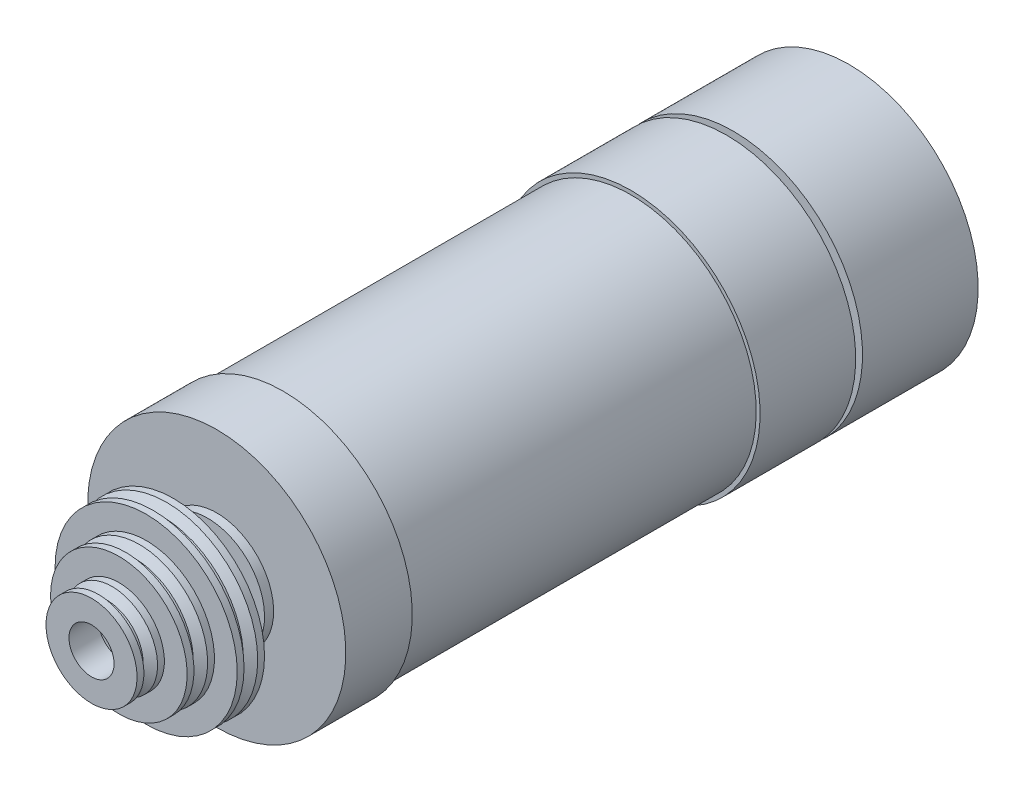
ISO-10303-21;
HEADER;
FILE_DESCRIPTION(('STEP AP214'),'2;1');
FILE_NAME('part.step','',(''),(''),'','','');
FILE_SCHEMA(('AUTOMOTIVE_DESIGN { 1 0 10303 214 1 1 1 1 }'));
ENDSEC;
DATA;
#1=APPLICATION_CONTEXT('core data for automotive mechanical design processes');
#2=APPLICATION_PROTOCOL_DEFINITION('international standard','automotive_design',2000,#1);
#3=PRODUCT_CONTEXT('',#1,'mechanical');
#4=PRODUCT('Part','Part','',(#3));
#5=PRODUCT_RELATED_PRODUCT_CATEGORY('part','',(#4));
#6=PRODUCT_DEFINITION_FORMATION('','',#4);
#7=PRODUCT_DEFINITION_CONTEXT('part definition',#1,'design');
#8=PRODUCT_DEFINITION('design','',#6,#7);
#9=PRODUCT_DEFINITION_SHAPE('','',#8);
#10=(LENGTH_UNIT() NAMED_UNIT(*) SI_UNIT(.MILLI.,.METRE.));
#11=(NAMED_UNIT(*) PLANE_ANGLE_UNIT() SI_UNIT($,.RADIAN.));
#12=(NAMED_UNIT(*) SI_UNIT($,.STERADIAN.) SOLID_ANGLE_UNIT());
#13=UNCERTAINTY_MEASURE_WITH_UNIT(LENGTH_MEASURE(1.E-05),#10,'distance_accuracy_value','');
#14=(GEOMETRIC_REPRESENTATION_CONTEXT(3) GLOBAL_UNCERTAINTY_ASSIGNED_CONTEXT((#13)) GLOBAL_UNIT_ASSIGNED_CONTEXT((#10,
#11,#12)) REPRESENTATION_CONTEXT('',''));
#15=CARTESIAN_POINT('',(0.,0.,0.));
#16=DIRECTION('',(0.,0.,1.));
#17=DIRECTION('',(1.,0.,0.));
#18=AXIS2_PLACEMENT_3D('',#15,#16,#17);
#19=CARTESIAN_POINT('',(0.,0.,96.9503713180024));
#20=DIRECTION('',(0.,0.,1.));
#21=DIRECTION('',(0.,-1.,0.));
#22=AXIS2_PLACEMENT_3D('',#19,#20,#21);
#23=CYLINDRICAL_SURFACE('',#22,4.94999999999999);
#24=CARTESIAN_POINT('',(0.,0.,58.5));
#25=DIRECTION('',(0.,0.,-1.));
#26=DIRECTION('',(-1.,0.,0.));
#27=AXIS2_PLACEMENT_3D('',#24,#25,#26);
#28=CIRCLE('',#27,4.94999999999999);
#29=CARTESIAN_POINT('',(-4.94999999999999,0.,58.5));
#30=VERTEX_POINT('',#29);
#31=EDGE_CURVE('E186',#30,#30,#28,.T.);
#32=ORIENTED_EDGE('',*,*,#31,.T.);
#33=EDGE_LOOP('',(#32));
#34=FACE_BOUND('',#33,.T.);
#35=CARTESIAN_POINT('',(0.,0.,58.));
#36=DIRECTION('',(0.,0.,1.));
#37=DIRECTION('',(0.,-1.,0.));
#38=AXIS2_PLACEMENT_3D('',#35,#36,#37);
#39=CIRCLE('',#38,4.94999999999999);
#40=CARTESIAN_POINT('',(0.,-4.94999999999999,58.));
#41=VERTEX_POINT('',#40);
#42=EDGE_CURVE('E10',#41,#41,#39,.T.);
#43=ORIENTED_EDGE('',*,*,#42,.T.);
#44=EDGE_LOOP('',(#43));
#45=FACE_BOUND('',#44,.T.);
#46=ADVANCED_FACE('F38',(#34,#45),#23,.T.);
#47=CARTESIAN_POINT('',(0.,4.95,58.));
#48=DIRECTION('',(0.,0.,-1.));
#49=DIRECTION('',(0.,1.,0.));
#50=AXIS2_PLACEMENT_3D('',#47,#48,#49);
#51=PLANE('',#50);
#52=ORIENTED_EDGE('',*,*,#42,.F.);
#53=EDGE_LOOP('',(#52));
#54=FACE_BOUND('',#53,.T.);
#55=CARTESIAN_POINT('',(0.,0.,58.));
#56=DIRECTION('',(0.,0.,1.));
#57=DIRECTION('',(0.,-1.,0.));
#58=AXIS2_PLACEMENT_3D('',#55,#56,#57);
#59=CIRCLE('',#58,12.5);
#60=CARTESIAN_POINT('',(0.,-12.5,58.));
#61=VERTEX_POINT('',#60);
#62=EDGE_CURVE('E46',#61,#61,#59,.T.);
#63=ORIENTED_EDGE('',*,*,#62,.T.);
#64=EDGE_LOOP('',(#63));
#65=FACE_BOUND('',#64,.T.);
#66=ADVANCED_FACE('F219',(#54,#65),#51,.F.);
#67=CARTESIAN_POINT('',(0.,0.,96.9503713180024));
#68=DIRECTION('',(0.,0.,1.));
#69=DIRECTION('',(0.,-1.,0.));
#70=AXIS2_PLACEMENT_3D('',#67,#68,#69);
#71=CYLINDRICAL_SURFACE('',#70,12.5);
#72=ORIENTED_EDGE('',*,*,#62,.F.);
#73=EDGE_LOOP('',(#72));
#74=FACE_BOUND('',#73,.T.);
#75=CARTESIAN_POINT('',(0.,0.,56.));
#76=DIRECTION('',(0.,0.,1.));
#77=DIRECTION('',(0.,-1.,0.));
#78=AXIS2_PLACEMENT_3D('',#75,#76,#77);
#79=CIRCLE('',#78,12.5);
#80=CARTESIAN_POINT('',(0.,-12.5,56.));
#81=VERTEX_POINT('',#80);
#82=EDGE_CURVE('E51',#81,#81,#79,.T.);
#83=ORIENTED_EDGE('',*,*,#82,.T.);
#84=EDGE_LOOP('',(#83));
#85=FACE_BOUND('',#84,.T.);
#86=ADVANCED_FACE('F223',(#74,#85),#71,.T.);
#87=CARTESIAN_POINT('',(0.,12.5,56.));
#88=DIRECTION('',(0.,0.,-1.));
#89=DIRECTION('',(0.,1.,0.));
#90=AXIS2_PLACEMENT_3D('',#87,#88,#89);
#91=PLANE('',#90);
#92=ORIENTED_EDGE('',*,*,#82,.F.);
#93=EDGE_LOOP('',(#92));
#94=FACE_BOUND('',#93,.T.);
#95=CARTESIAN_POINT('',(0.,0.,56.));
#96=DIRECTION('',(0.,0.,1.));
#97=DIRECTION('',(0.,-1.,0.));
#98=AXIS2_PLACEMENT_3D('',#95,#96,#97);
#99=CIRCLE('',#98,28.35);
#100=CARTESIAN_POINT('',(0.,-28.35,56.));
#101=VERTEX_POINT('',#100);
#102=EDGE_CURVE('E56',#101,#101,#99,.T.);
#103=ORIENTED_EDGE('',*,*,#102,.T.);
#104=EDGE_LOOP('',(#103));
#105=FACE_BOUND('',#104,.T.);
#106=ADVANCED_FACE('F229',(#94,#105),#91,.F.);
#107=CARTESIAN_POINT('',(0.,0.,96.9503713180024));
#108=DIRECTION('',(0.,0.,1.));
#109=DIRECTION('',(0.,-1.,0.));
#110=AXIS2_PLACEMENT_3D('',#107,#108,#109);
#111=CYLINDRICAL_SURFACE('',#110,28.35);
#112=ORIENTED_EDGE('',*,*,#102,.F.);
#113=EDGE_LOOP('',(#112));
#114=FACE_BOUND('',#113,.T.);
#115=CARTESIAN_POINT('',(0.,0.,41.4));
#116=DIRECTION('',(0.,0.,1.));
#117=DIRECTION('',(0.,-1.,0.));
#118=AXIS2_PLACEMENT_3D('',#115,#116,#117);
#119=CIRCLE('',#118,28.35);
#120=CARTESIAN_POINT('',(0.,-28.35,41.4));
#121=VERTEX_POINT('',#120);
#122=EDGE_CURVE('E62',#121,#121,#119,.T.);
#123=ORIENTED_EDGE('',*,*,#122,.T.);
#124=EDGE_LOOP('',(#123));
#125=FACE_BOUND('',#124,.T.);
#126=ADVANCED_FACE('F233',(#114,#125),#111,.T.);
#127=CARTESIAN_POINT('',(0.,28.35,41.4));
#128=DIRECTION('',(0.,0.,1.));
#129=DIRECTION('',(0.,-1.,0.));
#130=AXIS2_PLACEMENT_3D('',#127,#128,#129);
#131=PLANE('',#130);
#132=ORIENTED_EDGE('',*,*,#122,.F.);
#133=EDGE_LOOP('',(#132));
#134=FACE_BOUND('',#133,.T.);
#135=CARTESIAN_POINT('',(0.,0.,41.4));
#136=DIRECTION('',(0.,0.,1.));
#137=DIRECTION('',(0.,-1.,0.));
#138=AXIS2_PLACEMENT_3D('',#135,#136,#137);
#139=CIRCLE('',#138,27.5);
#140=CARTESIAN_POINT('',(0.,-27.5,41.4));
#141=VERTEX_POINT('',#140);
#142=EDGE_CURVE('E66',#141,#141,#139,.T.);
#143=ORIENTED_EDGE('',*,*,#142,.T.);
#144=EDGE_LOOP('',(#143));
#145=FACE_BOUND('',#144,.T.);
#146=ADVANCED_FACE('F237',(#134,#145),#131,.F.);
#147=CARTESIAN_POINT('',(0.,0.,96.9503713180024));
#148=DIRECTION('',(0.,0.,1.));
#149=DIRECTION('',(0.,-1.,0.));
#150=AXIS2_PLACEMENT_3D('',#147,#148,#149);
#151=CYLINDRICAL_SURFACE('',#150,27.5);
#152=ORIENTED_EDGE('',*,*,#142,.F.);
#153=EDGE_LOOP('',(#152));
#154=FACE_BOUND('',#153,.T.);
#155=CARTESIAN_POINT('',(0.,0.,-35.));
#156=DIRECTION('',(0.,0.,1.));
#157=DIRECTION('',(0.,-1.,0.));
#158=AXIS2_PLACEMENT_3D('',#155,#156,#157);
#159=CIRCLE('',#158,27.5);
#160=CARTESIAN_POINT('',(0.,-27.5,-35.));
#161=VERTEX_POINT('',#160);
#162=EDGE_CURVE('E70',#161,#161,#159,.T.);
#163=ORIENTED_EDGE('',*,*,#162,.T.);
#164=EDGE_LOOP('',(#163));
#165=FACE_BOUND('',#164,.T.);
#166=ADVANCED_FACE('F241',(#154,#165),#151,.T.);
#167=CARTESIAN_POINT('',(0.,27.5,-35.));
#168=DIRECTION('',(0.,0.,-1.));
#169=DIRECTION('',(0.,1.,0.));
#170=AXIS2_PLACEMENT_3D('',#167,#168,#169);
#171=PLANE('',#170);
#172=ORIENTED_EDGE('',*,*,#162,.F.);
#173=EDGE_LOOP('',(#172));
#174=FACE_BOUND('',#173,.T.);
#175=CARTESIAN_POINT('',(0.,0.,-35.));
#176=DIRECTION('',(0.,0.,1.));
#177=DIRECTION('',(0.,-1.,0.));
#178=AXIS2_PLACEMENT_3D('',#175,#176,#177);
#179=CIRCLE('',#178,28.35);
#180=CARTESIAN_POINT('',(0.,-28.35,-35.));
#181=VERTEX_POINT('',#180);
#182=EDGE_CURVE('E74',#181,#181,#179,.T.);
#183=ORIENTED_EDGE('',*,*,#182,.T.);
#184=EDGE_LOOP('',(#183));
#185=FACE_BOUND('',#184,.T.);
#186=ADVANCED_FACE('F245',(#174,#185),#171,.F.);
#187=CARTESIAN_POINT('',(0.,0.,96.9503713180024));
#188=DIRECTION('',(0.,0.,1.));
#189=DIRECTION('',(0.,-1.,0.));
#190=AXIS2_PLACEMENT_3D('',#187,#188,#189);
#191=CYLINDRICAL_SURFACE('',#190,28.35);
#192=ORIENTED_EDGE('',*,*,#182,.F.);
#193=EDGE_LOOP('',(#192));
#194=FACE_BOUND('',#193,.T.);
#195=CARTESIAN_POINT('',(0.,0.,-56.));
#196=DIRECTION('',(0.,0.,1.));
#197=DIRECTION('',(0.,-1.,0.));
#198=AXIS2_PLACEMENT_3D('',#195,#196,#197);
#199=CIRCLE('',#198,28.35);
#200=CARTESIAN_POINT('',(0.,-28.3499999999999,-56.));
#201=VERTEX_POINT('',#200);
#202=EDGE_CURVE('E78',#201,#201,#199,.T.);
#203=ORIENTED_EDGE('',*,*,#202,.T.);
#204=EDGE_LOOP('',(#203));
#205=FACE_BOUND('',#204,.T.);
#206=ADVANCED_FACE('F249',(#194,#205),#191,.T.);
#207=CARTESIAN_POINT('',(0.,28.35,-56.));
#208=DIRECTION('',(0.,0.,1.));
#209=DIRECTION('',(0.,-1.,0.));
#210=AXIS2_PLACEMENT_3D('',#207,#208,#209);
#211=PLANE('',#210);
#212=ORIENTED_EDGE('',*,*,#202,.F.);
#213=EDGE_LOOP('',(#212));
#214=FACE_BOUND('',#213,.T.);
#215=CARTESIAN_POINT('',(0.,0.,-56.));
#216=DIRECTION('',(0.,0.,1.));
#217=DIRECTION('',(0.,-1.,0.));
#218=AXIS2_PLACEMENT_3D('',#215,#216,#217);
#219=CIRCLE('',#218,9.99999999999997);
#220=CARTESIAN_POINT('',(0.,-9.99999999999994,-56.));
#221=VERTEX_POINT('',#220);
#222=EDGE_CURVE('E82',#221,#221,#219,.T.);
#223=ORIENTED_EDGE('',*,*,#222,.T.);
#224=EDGE_LOOP('',(#223));
#225=FACE_BOUND('',#224,.T.);
#226=ADVANCED_FACE('F253',(#214,#225),#211,.F.);
#227=CARTESIAN_POINT('',(0.,0.,96.9503713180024));
#228=DIRECTION('',(0.,0.,1.));
#229=DIRECTION('',(0.,-1.,0.));
#230=AXIS2_PLACEMENT_3D('',#227,#228,#229);
#231=CYLINDRICAL_SURFACE('',#230,9.99999999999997);
#232=ORIENTED_EDGE('',*,*,#222,.F.);
#233=EDGE_LOOP('',(#232));
#234=FACE_BOUND('',#233,.T.);
#235=CARTESIAN_POINT('',(0.,0.,-57.5));
#236=DIRECTION('',(0.,0.,1.));
#237=DIRECTION('',(0.,-1.,0.));
#238=AXIS2_PLACEMENT_3D('',#235,#236,#237);
#239=CIRCLE('',#238,9.99999999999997);
#240=CARTESIAN_POINT('',(0.,-9.99999999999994,-57.5));
#241=VERTEX_POINT('',#240);
#242=EDGE_CURVE('E86',#241,#241,#239,.T.);
#243=ORIENTED_EDGE('',*,*,#242,.T.);
#244=EDGE_LOOP('',(#243));
#245=FACE_BOUND('',#244,.T.);
#246=ADVANCED_FACE('F257',(#234,#245),#231,.T.);
#247=CARTESIAN_POINT('',(0.,10.,-57.5));
#248=DIRECTION('',(0.,0.,-1.));
#249=DIRECTION('',(0.,1.,0.));
#250=AXIS2_PLACEMENT_3D('',#247,#248,#249);
#251=PLANE('',#250);
#252=ORIENTED_EDGE('',*,*,#242,.F.);
#253=EDGE_LOOP('',(#252));
#254=FACE_BOUND('',#253,.T.);
#255=CARTESIAN_POINT('',(0.,0.,-57.5));
#256=DIRECTION('',(0.,0.,1.));
#257=DIRECTION('',(0.,-1.,0.));
#258=AXIS2_PLACEMENT_3D('',#255,#256,#257);
#259=CIRCLE('',#258,28.35);
#260=CARTESIAN_POINT('',(0.,-28.3499999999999,-57.5));
#261=VERTEX_POINT('',#260);
#262=EDGE_CURVE('E90',#261,#261,#259,.T.);
#263=ORIENTED_EDGE('',*,*,#262,.T.);
#264=EDGE_LOOP('',(#263));
#265=FACE_BOUND('',#264,.T.);
#266=ADVANCED_FACE('F261',(#254,#265),#251,.F.);
#267=CARTESIAN_POINT('',(0.,0.,96.9503713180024));
#268=DIRECTION('',(0.,0.,1.));
#269=DIRECTION('',(0.,-1.,0.));
#270=AXIS2_PLACEMENT_3D('',#267,#268,#269);
#271=CYLINDRICAL_SURFACE('',#270,28.35);
#272=ORIENTED_EDGE('',*,*,#262,.F.);
#273=EDGE_LOOP('',(#272));
#274=FACE_BOUND('',#273,.T.);
#275=CARTESIAN_POINT('',(0.,0.,-82.9));
#276=DIRECTION('',(0.,0.,1.));
#277=DIRECTION('',(0.,-1.,0.));
#278=AXIS2_PLACEMENT_3D('',#275,#276,#277);
#279=CIRCLE('',#278,28.35);
#280=CARTESIAN_POINT('',(0.,-28.3499999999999,-82.9));
#281=VERTEX_POINT('',#280);
#282=EDGE_CURVE('E94',#281,#281,#279,.T.);
#283=ORIENTED_EDGE('',*,*,#282,.T.);
#284=EDGE_LOOP('',(#283));
#285=FACE_BOUND('',#284,.T.);
#286=ADVANCED_FACE('F265',(#274,#285),#271,.T.);
#287=CARTESIAN_POINT('',(0.,28.35,-82.9));
#288=DIRECTION('',(0.,0.,1.));
#289=DIRECTION('',(0.,-1.,0.));
#290=AXIS2_PLACEMENT_3D('',#287,#288,#289);
#291=PLANE('',#290);
#292=ORIENTED_EDGE('',*,*,#282,.F.);
#293=EDGE_LOOP('',(#292));
#294=FACE_BOUND('',#293,.T.);
#295=CARTESIAN_POINT('',(0.,0.,-82.9));
#296=DIRECTION('',(0.,0.,1.));
#297=DIRECTION('',(0.,-1.,0.));
#298=AXIS2_PLACEMENT_3D('',#295,#296,#297);
#299=CIRCLE('',#298,4.94999999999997);
#300=CARTESIAN_POINT('',(0.,-4.94999999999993,-82.9));
#301=VERTEX_POINT('',#300);
#302=EDGE_CURVE('E98',#301,#301,#299,.T.);
#303=ORIENTED_EDGE('',*,*,#302,.T.);
#304=EDGE_LOOP('',(#303));
#305=FACE_BOUND('',#304,.T.);
#306=ADVANCED_FACE('F269',(#294,#305),#291,.F.);
#307=CARTESIAN_POINT('',(0.,0.,96.9503713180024));
#308=DIRECTION('',(0.,0.,1.));
#309=DIRECTION('',(0.,-1.,0.));
#310=AXIS2_PLACEMENT_3D('',#307,#308,#309);
#311=CYLINDRICAL_SURFACE('',#310,4.94999999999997);
#312=ORIENTED_EDGE('',*,*,#302,.F.);
#313=EDGE_LOOP('',(#312));
#314=FACE_BOUND('',#313,.T.);
#315=CARTESIAN_POINT('',(0.,0.,-85.7));
#316=DIRECTION('',(0.,0.,1.));
#317=DIRECTION('',(0.,-1.,0.));
#318=AXIS2_PLACEMENT_3D('',#315,#316,#317);
#319=CIRCLE('',#318,4.94999999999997);
#320=CARTESIAN_POINT('',(0.,-4.94999999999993,-85.7));
#321=VERTEX_POINT('',#320);
#322=EDGE_CURVE('E102',#321,#321,#319,.T.);
#323=ORIENTED_EDGE('',*,*,#322,.T.);
#324=EDGE_LOOP('',(#323));
#325=FACE_BOUND('',#324,.T.);
#326=ADVANCED_FACE('F273',(#314,#325),#311,.T.);
#327=CARTESIAN_POINT('',(0.,4.95,-85.7));
#328=DIRECTION('',(0.,0.,1.));
#329=DIRECTION('',(0.,-1.,0.));
#330=AXIS2_PLACEMENT_3D('',#327,#328,#329);
#331=PLANE('',#330);
#332=ORIENTED_EDGE('',*,*,#322,.F.);
#333=EDGE_LOOP('',(#332));
#334=FACE_BOUND('',#333,.T.);
#335=ADVANCED_FACE('F214',(#334),#331,.F.);
#336=CARTESIAN_POINT('',(0.,0.,0.));
#337=DIRECTION('',(0.,0.,-1.));
#338=DIRECTION('',(-1.,0.,0.));
#339=AXIS2_PLACEMENT_3D('',#336,#337,#338);
#340=CYLINDRICAL_SURFACE('',#339,4.94999999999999);
#341=CARTESIAN_POINT('',(0.,0.,83.5));
#342=DIRECTION('',(0.,0.,-1.));
#343=DIRECTION('',(-1.,0.,0.));
#344=AXIS2_PLACEMENT_3D('',#341,#342,#343);
#345=CIRCLE('',#344,4.94999999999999);
#346=CARTESIAN_POINT('',(-4.94999999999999,0.,83.5));
#347=VERTEX_POINT('',#346);
#348=EDGE_CURVE('E182',#347,#347,#345,.T.);
#349=ORIENTED_EDGE('',*,*,#348,.F.);
#350=EDGE_LOOP('',(#349));
#351=FACE_BOUND('',#350,.T.);
#352=CARTESIAN_POINT('',(0.,0.,77.));
#353=DIRECTION('',(0.,0.,-1.));
#354=DIRECTION('',(0.,1.,0.));
#355=AXIS2_PLACEMENT_3D('',#352,#353,#354);
#356=CIRCLE('',#355,4.94999999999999);
#357=CARTESIAN_POINT('',(0.,4.94999999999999,77.));
#358=VERTEX_POINT('',#357);
#359=EDGE_CURVE('E106',#358,#358,#356,.F.);
#360=ORIENTED_EDGE('',*,*,#359,.F.);
#361=EDGE_LOOP('',(#360));
#362=FACE_BOUND('',#361,.T.);
#363=ADVANCED_FACE('F205',(#351,#362),#340,.F.);
#364=CARTESIAN_POINT('',(0.,20.,65.5));
#365=DIRECTION('',(0.,0.,-1.));
#366=DIRECTION('',(-1.,0.,0.));
#367=AXIS2_PLACEMENT_3D('',#364,#365,#366);
#368=PLANE('',#367);
#369=CARTESIAN_POINT('',(0.,0.,65.5));
#370=DIRECTION('',(0.,0.,-1.));
#371=DIRECTION('',(-1.,0.,0.));
#372=AXIS2_PLACEMENT_3D('',#369,#370,#371);
#373=CIRCLE('',#372,20.);
#374=CARTESIAN_POINT('',(-20.,0.,65.5));
#375=VERTEX_POINT('',#374);
#376=EDGE_CURVE('E110',#375,#375,#373,.T.);
#377=ORIENTED_EDGE('',*,*,#376,.T.);
#378=EDGE_LOOP('',(#377));
#379=FACE_BOUND('',#378,.T.);
#380=CARTESIAN_POINT('',(0.,0.,65.5));
#381=DIRECTION('',(0.,0.,-1.));
#382=DIRECTION('',(-1.,0.,0.));
#383=AXIS2_PLACEMENT_3D('',#380,#381,#382);
#384=CIRCLE('',#383,8.99999999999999);
#385=CARTESIAN_POINT('',(-8.99999999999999,0.,65.5));
#386=VERTEX_POINT('',#385);
#387=EDGE_CURVE('E194',#386,#386,#384,.T.);
#388=ORIENTED_EDGE('',*,*,#387,.F.);
#389=EDGE_LOOP('',(#388));
#390=FACE_BOUND('',#389,.T.);
#391=ADVANCED_FACE('F202',(#379,#390),#368,.T.);
#392=CARTESIAN_POINT('',(0.,0.,0.));
#393=DIRECTION('',(0.,0.,-1.));
#394=DIRECTION('',(-1.,0.,0.));
#395=AXIS2_PLACEMENT_3D('',#392,#393,#394);
#396=CYLINDRICAL_SURFACE('',#395,20.);
#397=CARTESIAN_POINT('',(0.,0.,67.));
#398=DIRECTION('',(0.,0.,-1.));
#399=DIRECTION('',(-1.,0.,0.));
#400=AXIS2_PLACEMENT_3D('',#397,#398,#399);
#401=CIRCLE('',#400,20.);
#402=CARTESIAN_POINT('',(-20.,0.,67.));
#403=VERTEX_POINT('',#402);
#404=EDGE_CURVE('E114',#403,#403,#401,.T.);
#405=ORIENTED_EDGE('',*,*,#404,.T.);
#406=EDGE_LOOP('',(#405));
#407=FACE_BOUND('',#406,.T.);
#408=ORIENTED_EDGE('',*,*,#376,.F.);
#409=EDGE_LOOP('',(#408));
#410=FACE_BOUND('',#409,.T.);
#411=ADVANCED_FACE('F204',(#407,#410),#396,.T.);
#412=CARTESIAN_POINT('',(0.,0.,67.));
#413=DIRECTION('',(0.,0.,-1.));
#414=DIRECTION('',(-1.,0.,0.));
#415=AXIS2_PLACEMENT_3D('',#412,#413,#414);
#416=CONICAL_SURFACE('',#415,20.,1.0471975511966);
#417=CARTESIAN_POINT('',(0.,0.,68.1547005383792));
#418=DIRECTION('',(0.,0.,-1.));
#419=DIRECTION('',(-1.,0.,0.));
#420=AXIS2_PLACEMENT_3D('',#417,#418,#419);
#421=CIRCLE('',#420,18.);
#422=CARTESIAN_POINT('',(-18.,0.,68.1547005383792));
#423=VERTEX_POINT('',#422);
#424=EDGE_CURVE('E118',#423,#423,#421,.T.);
#425=ORIENTED_EDGE('',*,*,#424,.T.);
#426=EDGE_LOOP('',(#425));
#427=FACE_BOUND('',#426,.T.);
#428=ORIENTED_EDGE('',*,*,#404,.F.);
#429=EDGE_LOOP('',(#428));
#430=FACE_BOUND('',#429,.T.);
#431=ADVANCED_FACE('F211',(#427,#430),#416,.T.);
#432=CARTESIAN_POINT('',(0.,0.,0.));
#433=DIRECTION('',(0.,0.,-1.));
#434=DIRECTION('',(-1.,0.,0.));
#435=AXIS2_PLACEMENT_3D('',#432,#433,#434);
#436=CYLINDRICAL_SURFACE('',#435,18.);
#437=CARTESIAN_POINT('',(0.,0.,68.8452994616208));
#438=DIRECTION('',(0.,0.,-1.));
#439=DIRECTION('',(-1.,0.,0.));
#440=AXIS2_PLACEMENT_3D('',#437,#438,#439);
#441=CIRCLE('',#440,18.);
#442=CARTESIAN_POINT('',(-18.,0.,68.8452994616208));
#443=VERTEX_POINT('',#442);
#444=EDGE_CURVE('E122',#443,#443,#441,.T.);
#445=ORIENTED_EDGE('',*,*,#444,.T.);
#446=EDGE_LOOP('',(#445));
#447=FACE_BOUND('',#446,.T.);
#448=ORIENTED_EDGE('',*,*,#424,.F.);
#449=EDGE_LOOP('',(#448));
#450=FACE_BOUND('',#449,.T.);
#451=ADVANCED_FACE('F395',(#447,#450),#436,.T.);
#452=CARTESIAN_POINT('',(0.,0.,68.8452994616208));
#453=DIRECTION('',(0.,0.,1.));
#454=DIRECTION('',(1.,0.,0.));
#455=AXIS2_PLACEMENT_3D('',#452,#453,#454);
#456=CONICAL_SURFACE('',#455,18.,1.0471975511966);
#457=CARTESIAN_POINT('',(0.,0.,70.));
#458=DIRECTION('',(0.,0.,-1.));
#459=DIRECTION('',(-1.,0.,0.));
#460=AXIS2_PLACEMENT_3D('',#457,#458,#459);
#461=CIRCLE('',#460,20.);
#462=CARTESIAN_POINT('',(-20.,0.,70.));
#463=VERTEX_POINT('',#462);
#464=EDGE_CURVE('E126',#463,#463,#461,.T.);
#465=ORIENTED_EDGE('',*,*,#464,.T.);
#466=EDGE_LOOP('',(#465));
#467=FACE_BOUND('',#466,.T.);
#468=ORIENTED_EDGE('',*,*,#444,.F.);
#469=EDGE_LOOP('',(#468));
#470=FACE_BOUND('',#469,.T.);
#471=ADVANCED_FACE('F406',(#467,#470),#456,.T.);
#472=CARTESIAN_POINT('',(0.,0.,0.));
#473=DIRECTION('',(0.,0.,-1.));
#474=DIRECTION('',(-1.,0.,0.));
#475=AXIS2_PLACEMENT_3D('',#472,#473,#474);
#476=CYLINDRICAL_SURFACE('',#475,20.);
#477=CARTESIAN_POINT('',(0.,0.,71.5));
#478=DIRECTION('',(0.,0.,-1.));
#479=DIRECTION('',(-1.,0.,0.));
#480=AXIS2_PLACEMENT_3D('',#477,#478,#479);
#481=CIRCLE('',#480,20.);
#482=CARTESIAN_POINT('',(-20.,0.,71.5));
#483=VERTEX_POINT('',#482);
#484=EDGE_CURVE('E130',#483,#483,#481,.T.);
#485=ORIENTED_EDGE('',*,*,#484,.T.);
#486=EDGE_LOOP('',(#485));
#487=FACE_BOUND('',#486,.T.);
#488=ORIENTED_EDGE('',*,*,#464,.F.);
#489=EDGE_LOOP('',(#488));
#490=FACE_BOUND('',#489,.T.);
#491=ADVANCED_FACE('F417',(#487,#490),#476,.T.);
#492=CARTESIAN_POINT('',(0.,20.,71.5));
#493=DIRECTION('',(0.,0.,1.));
#494=DIRECTION('',(1.,0.,0.));
#495=AXIS2_PLACEMENT_3D('',#492,#493,#494);
#496=PLANE('',#495);
#497=CARTESIAN_POINT('',(0.,0.,71.5));
#498=DIRECTION('',(0.,0.,-1.));
#499=DIRECTION('',(-1.,0.,0.));
#500=AXIS2_PLACEMENT_3D('',#497,#498,#499);
#501=CIRCLE('',#500,15.);
#502=CARTESIAN_POINT('',(-15.,0.,71.5));
#503=VERTEX_POINT('',#502);
#504=EDGE_CURVE('E134',#503,#503,#501,.T.);
#505=ORIENTED_EDGE('',*,*,#504,.T.);
#506=EDGE_LOOP('',(#505));
#507=FACE_BOUND('',#506,.T.);
#508=ORIENTED_EDGE('',*,*,#484,.F.);
#509=EDGE_LOOP('',(#508));
#510=FACE_BOUND('',#509,.T.);
#511=ADVANCED_FACE('F428',(#507,#510),#496,.T.);
#512=CARTESIAN_POINT('',(0.,0.,0.));
#513=DIRECTION('',(0.,0.,-1.));
#514=DIRECTION('',(-1.,0.,0.));
#515=AXIS2_PLACEMENT_3D('',#512,#513,#514);
#516=CYLINDRICAL_SURFACE('',#515,15.);
#517=CARTESIAN_POINT('',(0.,0.,73.));
#518=DIRECTION('',(0.,0.,-1.));
#519=DIRECTION('',(-1.,0.,0.));
#520=AXIS2_PLACEMENT_3D('',#517,#518,#519);
#521=CIRCLE('',#520,15.);
#522=CARTESIAN_POINT('',(-15.,0.,73.));
#523=VERTEX_POINT('',#522);
#524=EDGE_CURVE('E138',#523,#523,#521,.T.);
#525=ORIENTED_EDGE('',*,*,#524,.T.);
#526=EDGE_LOOP('',(#525));
#527=FACE_BOUND('',#526,.T.);
#528=ORIENTED_EDGE('',*,*,#504,.F.);
#529=EDGE_LOOP('',(#528));
#530=FACE_BOUND('',#529,.T.);
#531=ADVANCED_FACE('F439',(#527,#530),#516,.T.);
#532=CARTESIAN_POINT('',(0.,0.,73.));
#533=DIRECTION('',(0.,0.,-1.));
#534=DIRECTION('',(-1.,0.,0.));
#535=AXIS2_PLACEMENT_3D('',#532,#533,#534);
#536=CONICAL_SURFACE('',#535,15.,1.0471975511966);
#537=CARTESIAN_POINT('',(0.,0.,74.1547005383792));
#538=DIRECTION('',(0.,0.,-1.));
#539=DIRECTION('',(-1.,0.,0.));
#540=AXIS2_PLACEMENT_3D('',#537,#538,#539);
#541=CIRCLE('',#540,13.);
#542=CARTESIAN_POINT('',(-13.,0.,74.1547005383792));
#543=VERTEX_POINT('',#542);
#544=EDGE_CURVE('E142',#543,#543,#541,.T.);
#545=ORIENTED_EDGE('',*,*,#544,.T.);
#546=EDGE_LOOP('',(#545));
#547=FACE_BOUND('',#546,.T.);
#548=ORIENTED_EDGE('',*,*,#524,.F.);
#549=EDGE_LOOP('',(#548));
#550=FACE_BOUND('',#549,.T.);
#551=ADVANCED_FACE('F450',(#547,#550),#536,.T.);
#552=CARTESIAN_POINT('',(0.,0.,0.));
#553=DIRECTION('',(0.,0.,-1.));
#554=DIRECTION('',(-1.,0.,0.));
#555=AXIS2_PLACEMENT_3D('',#552,#553,#554);
#556=CYLINDRICAL_SURFACE('',#555,13.);
#557=CARTESIAN_POINT('',(0.,0.,74.8452994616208));
#558=DIRECTION('',(0.,0.,-1.));
#559=DIRECTION('',(-1.,0.,0.));
#560=AXIS2_PLACEMENT_3D('',#557,#558,#559);
#561=CIRCLE('',#560,13.);
#562=CARTESIAN_POINT('',(-13.,0.,74.8452994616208));
#563=VERTEX_POINT('',#562);
#564=EDGE_CURVE('E146',#563,#563,#561,.T.);
#565=ORIENTED_EDGE('',*,*,#564,.T.);
#566=EDGE_LOOP('',(#565));
#567=FACE_BOUND('',#566,.T.);
#568=ORIENTED_EDGE('',*,*,#544,.F.);
#569=EDGE_LOOP('',(#568));
#570=FACE_BOUND('',#569,.T.);
#571=ADVANCED_FACE('F461',(#567,#570),#556,.T.);
#572=CARTESIAN_POINT('',(0.,0.,74.8452994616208));
#573=DIRECTION('',(0.,0.,1.));
#574=DIRECTION('',(1.,0.,0.));
#575=AXIS2_PLACEMENT_3D('',#572,#573,#574);
#576=CONICAL_SURFACE('',#575,13.,1.0471975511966);
#577=CARTESIAN_POINT('',(0.,0.,76.));
#578=DIRECTION('',(0.,0.,-1.));
#579=DIRECTION('',(-1.,0.,0.));
#580=AXIS2_PLACEMENT_3D('',#577,#578,#579);
#581=CIRCLE('',#580,15.);
#582=CARTESIAN_POINT('',(-15.,0.,76.));
#583=VERTEX_POINT('',#582);
#584=EDGE_CURVE('E150',#583,#583,#581,.T.);
#585=ORIENTED_EDGE('',*,*,#584,.T.);
#586=EDGE_LOOP('',(#585));
#587=FACE_BOUND('',#586,.T.);
#588=ORIENTED_EDGE('',*,*,#564,.F.);
#589=EDGE_LOOP('',(#588));
#590=FACE_BOUND('',#589,.T.);
#591=ADVANCED_FACE('F472',(#587,#590),#576,.T.);
#592=CARTESIAN_POINT('',(0.,0.,0.));
#593=DIRECTION('',(0.,0.,-1.));
#594=DIRECTION('',(-1.,0.,0.));
#595=AXIS2_PLACEMENT_3D('',#592,#593,#594);
#596=CYLINDRICAL_SURFACE('',#595,15.);
#597=CARTESIAN_POINT('',(0.,0.,77.5));
#598=DIRECTION('',(0.,0.,-1.));
#599=DIRECTION('',(-1.,0.,0.));
#600=AXIS2_PLACEMENT_3D('',#597,#598,#599);
#601=CIRCLE('',#600,15.);
#602=CARTESIAN_POINT('',(-15.,0.,77.5));
#603=VERTEX_POINT('',#602);
#604=EDGE_CURVE('E154',#603,#603,#601,.T.);
#605=ORIENTED_EDGE('',*,*,#604,.T.);
#606=EDGE_LOOP('',(#605));
#607=FACE_BOUND('',#606,.T.);
#608=ORIENTED_EDGE('',*,*,#584,.F.);
#609=EDGE_LOOP('',(#608));
#610=FACE_BOUND('',#609,.T.);
#611=ADVANCED_FACE('F483',(#607,#610),#596,.T.);
#612=CARTESIAN_POINT('',(0.,15.,77.5));
#613=DIRECTION('',(0.,0.,1.));
#614=DIRECTION('',(1.,0.,0.));
#615=AXIS2_PLACEMENT_3D('',#612,#613,#614);
#616=PLANE('',#615);
#617=CARTESIAN_POINT('',(0.,0.,77.5));
#618=DIRECTION('',(0.,0.,-1.));
#619=DIRECTION('',(-1.,0.,0.));
#620=AXIS2_PLACEMENT_3D('',#617,#618,#619);
#621=CIRCLE('',#620,9.99999999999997);
#622=CARTESIAN_POINT('',(-9.99999999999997,0.,77.5));
#623=VERTEX_POINT('',#622);
#624=EDGE_CURVE('E158',#623,#623,#621,.T.);
#625=ORIENTED_EDGE('',*,*,#624,.T.);
#626=EDGE_LOOP('',(#625));
#627=FACE_BOUND('',#626,.T.);
#628=ORIENTED_EDGE('',*,*,#604,.F.);
#629=EDGE_LOOP('',(#628));
#630=FACE_BOUND('',#629,.T.);
#631=ADVANCED_FACE('F494',(#627,#630),#616,.T.);
#632=CARTESIAN_POINT('',(0.,0.,0.));
#633=DIRECTION('',(0.,0.,-1.));
#634=DIRECTION('',(-1.,0.,0.));
#635=AXIS2_PLACEMENT_3D('',#632,#633,#634);
#636=CYLINDRICAL_SURFACE('',#635,9.99999999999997);
#637=CARTESIAN_POINT('',(0.,0.,79.));
#638=DIRECTION('',(0.,0.,-1.));
#639=DIRECTION('',(-1.,0.,0.));
#640=AXIS2_PLACEMENT_3D('',#637,#638,#639);
#641=CIRCLE('',#640,9.99999999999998);
#642=CARTESIAN_POINT('',(-9.99999999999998,0.,79.));
#643=VERTEX_POINT('',#642);
#644=EDGE_CURVE('E162',#643,#643,#641,.T.);
#645=ORIENTED_EDGE('',*,*,#644,.T.);
#646=EDGE_LOOP('',(#645));
#647=FACE_BOUND('',#646,.T.);
#648=ORIENTED_EDGE('',*,*,#624,.F.);
#649=EDGE_LOOP('',(#648));
#650=FACE_BOUND('',#649,.T.);
#651=ADVANCED_FACE('F505',(#647,#650),#636,.T.);
#652=CARTESIAN_POINT('',(0.,0.,79.));
#653=DIRECTION('',(0.,0.,-1.));
#654=DIRECTION('',(-1.,0.,0.));
#655=AXIS2_PLACEMENT_3D('',#652,#653,#654);
#656=CONICAL_SURFACE('',#655,9.99999999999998,1.0471975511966);
#657=CARTESIAN_POINT('',(0.,0.,80.1547005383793));
#658=DIRECTION('',(0.,0.,-1.));
#659=DIRECTION('',(-1.,0.,0.));
#660=AXIS2_PLACEMENT_3D('',#657,#658,#659);
#661=CIRCLE('',#660,7.99999999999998);
#662=CARTESIAN_POINT('',(-7.99999999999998,0.,80.1547005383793));
#663=VERTEX_POINT('',#662);
#664=EDGE_CURVE('E166',#663,#663,#661,.T.);
#665=ORIENTED_EDGE('',*,*,#664,.T.);
#666=EDGE_LOOP('',(#665));
#667=FACE_BOUND('',#666,.T.);
#668=ORIENTED_EDGE('',*,*,#644,.F.);
#669=EDGE_LOOP('',(#668));
#670=FACE_BOUND('',#669,.T.);
#671=ADVANCED_FACE('F516',(#667,#670),#656,.T.);
#672=CARTESIAN_POINT('',(0.,0.,0.));
#673=DIRECTION('',(0.,0.,-1.));
#674=DIRECTION('',(-1.,0.,0.));
#675=AXIS2_PLACEMENT_3D('',#672,#673,#674);
#676=CYLINDRICAL_SURFACE('',#675,7.99999999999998);
#677=CARTESIAN_POINT('',(0.,0.,80.8452994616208));
#678=DIRECTION('',(0.,0.,-1.));
#679=DIRECTION('',(-1.,0.,0.));
#680=AXIS2_PLACEMENT_3D('',#677,#678,#679);
#681=CIRCLE('',#680,7.99999999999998);
#682=CARTESIAN_POINT('',(-7.99999999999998,0.,80.8452994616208));
#683=VERTEX_POINT('',#682);
#684=EDGE_CURVE('E170',#683,#683,#681,.T.);
#685=ORIENTED_EDGE('',*,*,#684,.T.);
#686=EDGE_LOOP('',(#685));
#687=FACE_BOUND('',#686,.T.);
#688=ORIENTED_EDGE('',*,*,#664,.F.);
#689=EDGE_LOOP('',(#688));
#690=FACE_BOUND('',#689,.T.);
#691=ADVANCED_FACE('F527',(#687,#690),#676,.T.);
#692=CARTESIAN_POINT('',(0.,0.,80.8452994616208));
#693=DIRECTION('',(0.,0.,1.));
#694=DIRECTION('',(1.,0.,0.));
#695=AXIS2_PLACEMENT_3D('',#692,#693,#694);
#696=CONICAL_SURFACE('',#695,7.99999999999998,1.0471975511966);
#697=CARTESIAN_POINT('',(0.,0.,82.));
#698=DIRECTION('',(0.,0.,-1.));
#699=DIRECTION('',(-1.,0.,0.));
#700=AXIS2_PLACEMENT_3D('',#697,#698,#699);
#701=CIRCLE('',#700,9.99999999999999);
#702=CARTESIAN_POINT('',(-9.99999999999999,0.,82.));
#703=VERTEX_POINT('',#702);
#704=EDGE_CURVE('E174',#703,#703,#701,.T.);
#705=ORIENTED_EDGE('',*,*,#704,.T.);
#706=EDGE_LOOP('',(#705));
#707=FACE_BOUND('',#706,.T.);
#708=ORIENTED_EDGE('',*,*,#684,.F.);
#709=EDGE_LOOP('',(#708));
#710=FACE_BOUND('',#709,.T.);
#711=ADVANCED_FACE('F538',(#707,#710),#696,.T.);
#712=CARTESIAN_POINT('',(0.,0.,0.));
#713=DIRECTION('',(0.,0.,-1.));
#714=DIRECTION('',(-1.,0.,0.));
#715=AXIS2_PLACEMENT_3D('',#712,#713,#714);
#716=CYLINDRICAL_SURFACE('',#715,9.99999999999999);
#717=CARTESIAN_POINT('',(0.,0.,83.5));
#718=DIRECTION('',(0.,0.,-1.));
#719=DIRECTION('',(-1.,0.,0.));
#720=AXIS2_PLACEMENT_3D('',#717,#718,#719);
#721=CIRCLE('',#720,9.99999999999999);
#722=CARTESIAN_POINT('',(-9.99999999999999,0.,83.5));
#723=VERTEX_POINT('',#722);
#724=EDGE_CURVE('E178',#723,#723,#721,.T.);
#725=ORIENTED_EDGE('',*,*,#724,.T.);
#726=EDGE_LOOP('',(#725));
#727=FACE_BOUND('',#726,.T.);
#728=ORIENTED_EDGE('',*,*,#704,.F.);
#729=EDGE_LOOP('',(#728));
#730=FACE_BOUND('',#729,.T.);
#731=ADVANCED_FACE('F549',(#727,#730),#716,.T.);
#732=CARTESIAN_POINT('',(0.,9.99999999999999,83.5));
#733=DIRECTION('',(0.,0.,1.));
#734=DIRECTION('',(1.,0.,0.));
#735=AXIS2_PLACEMENT_3D('',#732,#733,#734);
#736=PLANE('',#735);
#737=ORIENTED_EDGE('',*,*,#348,.T.);
#738=EDGE_LOOP('',(#737));
#739=FACE_BOUND('',#738,.T.);
#740=ORIENTED_EDGE('',*,*,#724,.F.);
#741=EDGE_LOOP('',(#740));
#742=FACE_BOUND('',#741,.T.);
#743=ADVANCED_FACE('F560',(#739,#742),#736,.T.);
#744=CARTESIAN_POINT('',(0.,8.99999999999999,58.5));
#745=DIRECTION('',(0.,0.,-1.));
#746=DIRECTION('',(-1.,0.,0.));
#747=AXIS2_PLACEMENT_3D('',#744,#745,#746);
#748=PLANE('',#747);
#749=CARTESIAN_POINT('',(0.,0.,58.5));
#750=DIRECTION('',(0.,0.,-1.));
#751=DIRECTION('',(-1.,0.,0.));
#752=AXIS2_PLACEMENT_3D('',#749,#750,#751);
#753=CIRCLE('',#752,8.99999999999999);
#754=CARTESIAN_POINT('',(-8.99999999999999,0.,58.5));
#755=VERTEX_POINT('',#754);
#756=EDGE_CURVE('E190',#755,#755,#753,.T.);
#757=ORIENTED_EDGE('',*,*,#756,.T.);
#758=EDGE_LOOP('',(#757));
#759=FACE_BOUND('',#758,.T.);
#760=ORIENTED_EDGE('',*,*,#31,.F.);
#761=EDGE_LOOP('',(#760));
#762=FACE_BOUND('',#761,.T.);
#763=ADVANCED_FACE('F571',(#759,#762),#748,.T.);
#764=CARTESIAN_POINT('',(0.,0.,0.));
#765=DIRECTION('',(0.,0.,-1.));
#766=DIRECTION('',(-1.,0.,0.));
#767=AXIS2_PLACEMENT_3D('',#764,#765,#766);
#768=CYLINDRICAL_SURFACE('',#767,8.99999999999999);
#769=ORIENTED_EDGE('',*,*,#387,.T.);
#770=EDGE_LOOP('',(#769));
#771=FACE_BOUND('',#770,.T.);
#772=ORIENTED_EDGE('',*,*,#756,.F.);
#773=EDGE_LOOP('',(#772));
#774=FACE_BOUND('',#773,.T.);
#775=ADVANCED_FACE('F199',(#771,#774),#768,.T.);
#776=CARTESIAN_POINT('',(0.,0.,77.));
#777=DIRECTION('',(0.,0.,-1.));
#778=DIRECTION('',(0.,1.,0.));
#779=AXIS2_PLACEMENT_3D('',#776,#777,#778);
#780=PLANE('',#779);
#781=ORIENTED_EDGE('',*,*,#359,.T.);
#782=EDGE_LOOP('',(#781));
#783=FACE_BOUND('',#782,.T.);
#784=ADVANCED_FACE('F40',(#783),#780,.F.);
#785=CLOSED_SHELL('',(#46,#66,#86,#106,#126,#146,#166,#186,#206,#226,#246,#266,#286,#306,#326,
#335,#363,#391,#411,#431,#451,#471,#491,#511,#531,#551,#571,#591,#611,#631,#651,#671,#691,#711,
#731,#743,#763,#775,#784));
#786=MANIFOLD_SOLID_BREP('B2',#785);
#787=ADVANCED_BREP_SHAPE_REPRESENTATION('',(#18,#786),#14);
#788=SHAPE_DEFINITION_REPRESENTATION(#9,#787);
ENDSEC;
END-ISO-10303-21;
